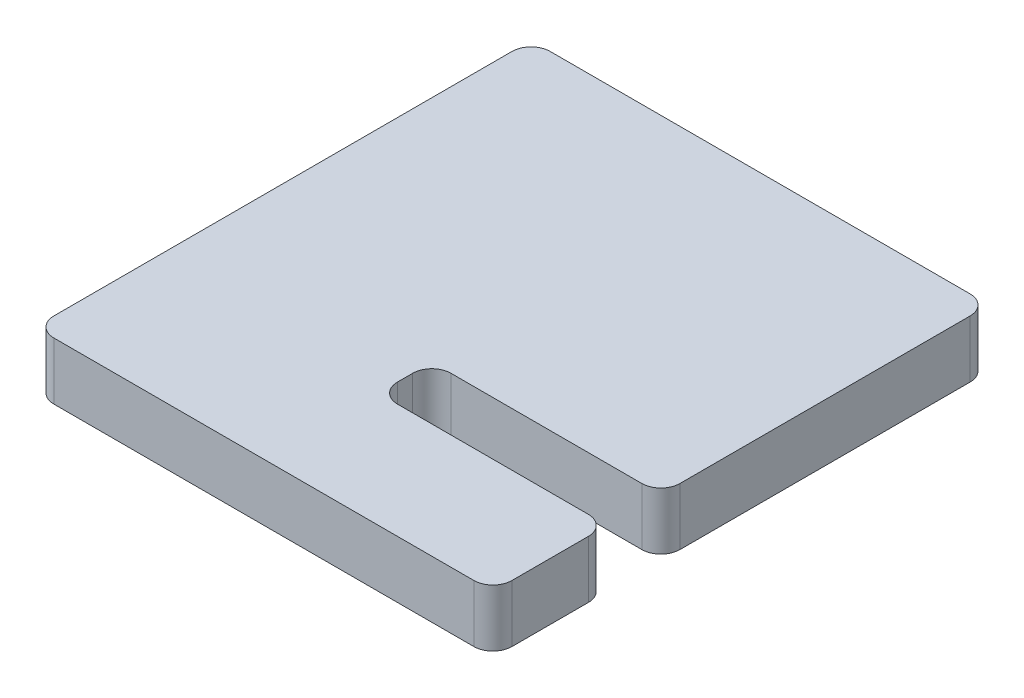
from build123d import *

# Parameters (mm, degrees)
BOSS_EXTRUDE1_DEPTH = 3
FILLET1_R           = 1


with BuildPart() as part:
    # Sketch1 → Boss-Extrude1 (new body)
    with BuildSketch(Plane(origin=(0, 0, 0), x_dir=(1, 0, 0), z_dir=(0, 1, 0))):
        Polygon((12, -7), (12, -13), (-12, -13), (-12, 13), (12, 13), (12, -4.2), (0, -4.2), (0, -7), align=None)
    extrude(amount=BOSS_EXTRUDE1_DEPTH)

    # Fillet1
    fillet1_edges = [part.edges().sort_by_distance(p)[0] for p in [
        (-12, 1.5, -13),
        (12, 1.5, -13),
        (12, 1.5, 4.2),
        (0, 1.5, 4.2),
        (0, 1.5, 7),
        (12, 1.5, 7),
        (12, 1.5, 13),
        (-12, 1.5, 13),
    ]]
    fillet(fillet1_edges, radius=FILLET1_R)


solid = part.part
